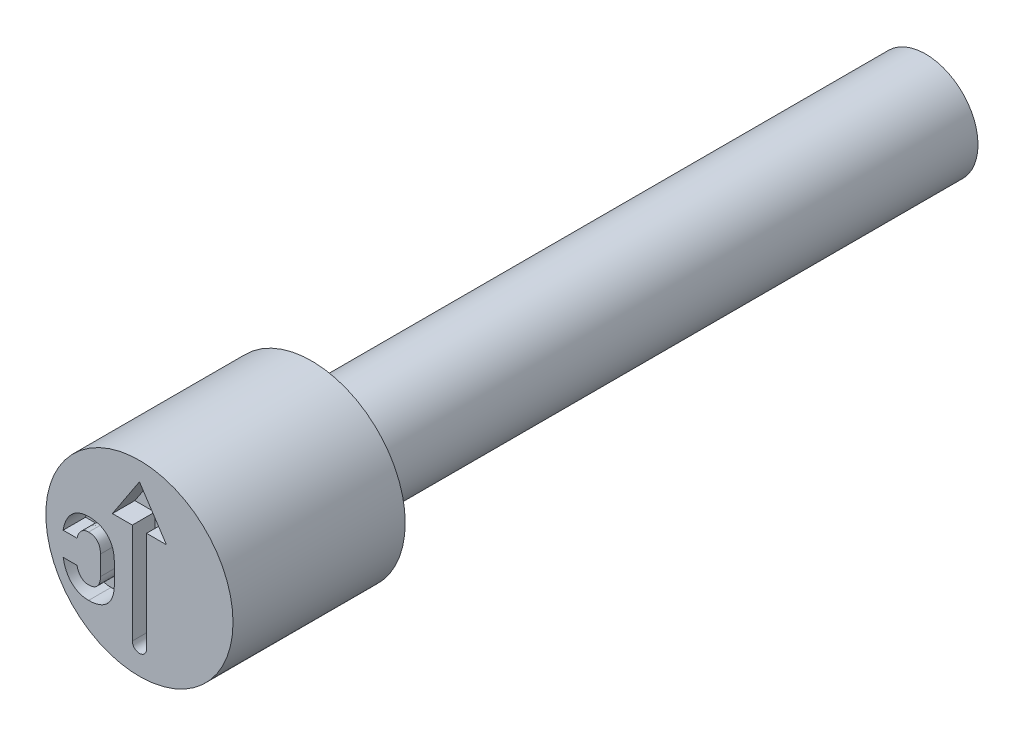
ISO-10303-21;
HEADER;
FILE_DESCRIPTION(('STEP AP214'),'2;1');
FILE_NAME('part.step','',(''),(''),'','','');
FILE_SCHEMA(('AUTOMOTIVE_DESIGN { 1 0 10303 214 1 1 1 1 }'));
ENDSEC;
DATA;
#1=APPLICATION_CONTEXT('core data for automotive mechanical design processes');
#2=APPLICATION_PROTOCOL_DEFINITION('international standard','automotive_design',2000,#1);
#3=PRODUCT_CONTEXT('',#1,'mechanical');
#4=PRODUCT('Part','Part','',(#3));
#5=PRODUCT_RELATED_PRODUCT_CATEGORY('part','',(#4));
#6=PRODUCT_DEFINITION_FORMATION('','',#4);
#7=PRODUCT_DEFINITION_CONTEXT('part definition',#1,'design');
#8=PRODUCT_DEFINITION('design','',#6,#7);
#9=PRODUCT_DEFINITION_SHAPE('','',#8);
#10=(LENGTH_UNIT() NAMED_UNIT(*) SI_UNIT(.MILLI.,.METRE.));
#11=(NAMED_UNIT(*) PLANE_ANGLE_UNIT() SI_UNIT($,.RADIAN.));
#12=(NAMED_UNIT(*) SI_UNIT($,.STERADIAN.) SOLID_ANGLE_UNIT());
#13=UNCERTAINTY_MEASURE_WITH_UNIT(LENGTH_MEASURE(1.E-05),#10,'distance_accuracy_value','');
#14=(GEOMETRIC_REPRESENTATION_CONTEXT(3) GLOBAL_UNCERTAINTY_ASSIGNED_CONTEXT((#13)) GLOBAL_UNIT_ASSIGNED_CONTEXT((#10,
#11,#12)) REPRESENTATION_CONTEXT('',''));
#15=CARTESIAN_POINT('',(0.,0.,0.));
#16=DIRECTION('',(0.,0.,1.));
#17=DIRECTION('',(1.,0.,0.));
#18=AXIS2_PLACEMENT_3D('',#15,#16,#17);
#19=CARTESIAN_POINT('',(0.,0.699999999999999,-2.3));
#20=DIRECTION('',(0.,0.,1.));
#21=DIRECTION('',(1.,0.,0.));
#22=AXIS2_PLACEMENT_3D('',#19,#20,#21);
#23=PLANE('',#22);
#24=CARTESIAN_POINT('',(0.,0.,-2.3));
#25=DIRECTION('',(0.,0.,1.));
#26=DIRECTION('',(1.,0.,0.));
#27=AXIS2_PLACEMENT_3D('',#24,#25,#26);
#28=CIRCLE('',#27,1.25);
#29=CARTESIAN_POINT('',(1.25,0.,-2.3));
#30=VERTEX_POINT('',#29);
#31=EDGE_CURVE('E11',#30,#30,#28,.T.);
#32=ORIENTED_EDGE('',*,*,#31,.F.);
#33=EDGE_LOOP('',(#32));
#34=FACE_BOUND('',#33,.T.);
#35=CARTESIAN_POINT('',(0.,0.,-2.3));
#36=DIRECTION('',(0.,0.,1.));
#37=DIRECTION('',(1.,0.,0.));
#38=AXIS2_PLACEMENT_3D('',#35,#36,#37);
#39=CIRCLE('',#38,0.699999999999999);
#40=CARTESIAN_POINT('',(0.699999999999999,0.,-2.3));
#41=VERTEX_POINT('',#40);
#42=EDGE_CURVE('E262',#41,#41,#39,.T.);
#43=ORIENTED_EDGE('',*,*,#42,.T.);
#44=EDGE_LOOP('',(#43));
#45=FACE_BOUND('',#44,.T.);
#46=ADVANCED_FACE('F34',(#34,#45),#23,.F.);
#47=CARTESIAN_POINT('',(0.,0.,-0.403888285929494));
#48=DIRECTION('',(0.,0.,1.));
#49=DIRECTION('',(1.,0.,0.));
#50=AXIS2_PLACEMENT_3D('',#47,#48,#49);
#51=CYLINDRICAL_SURFACE('',#50,1.25);
#52=CARTESIAN_POINT('',(0.,0.,0.));
#53=DIRECTION('',(0.,0.,1.));
#54=DIRECTION('',(1.,0.,0.));
#55=AXIS2_PLACEMENT_3D('',#52,#53,#54);
#56=CIRCLE('',#55,1.25);
#57=CARTESIAN_POINT('',(1.25,0.,0.));
#58=VERTEX_POINT('',#57);
#59=EDGE_CURVE('E41',#58,#58,#56,.T.);
#60=ORIENTED_EDGE('',*,*,#59,.F.);
#61=EDGE_LOOP('',(#60));
#62=FACE_BOUND('',#61,.T.);
#63=ORIENTED_EDGE('',*,*,#31,.T.);
#64=EDGE_LOOP('',(#63));
#65=FACE_BOUND('',#64,.T.);
#66=ADVANCED_FACE('F247',(#62,#65),#51,.T.);
#67=CARTESIAN_POINT('',(0.,1.25,0.));
#68=DIRECTION('',(0.,0.,-1.));
#69=DIRECTION('',(-1.,0.,0.));
#70=AXIS2_PLACEMENT_3D('',#67,#68,#69);
#71=PLANE('',#70);
#72=CARTESIAN_POINT('',(-0.678632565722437,-0.709873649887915,0.));
#73=CARTESIAN_POINT('',(-0.669787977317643,-0.709777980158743,0.));
#74=CARTESIAN_POINT('',(-0.652334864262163,-0.709589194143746,0.));
#75=CARTESIAN_POINT('',(-0.626671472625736,-0.70762484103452,0.));
#76=CARTESIAN_POINT('',(-0.601912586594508,-0.704341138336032,0.));
#77=CARTESIAN_POINT('',(-0.578193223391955,-0.69971053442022,0.));
#78=CARTESIAN_POINT('',(-0.555447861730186,-0.693868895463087,0.));
#79=CARTESIAN_POINT('',(-0.533579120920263,-0.686964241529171,0.));
#80=CARTESIAN_POINT('',(-0.512797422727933,-0.678416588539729,0.));
#81=CARTESIAN_POINT('',(-0.492901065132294,-0.668723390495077,0.));
#82=CARTESIAN_POINT('',(-0.474170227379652,-0.657752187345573,0.));
#83=CARTESIAN_POINT('',(-0.456644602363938,-0.645411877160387,0.));
#84=CARTESIAN_POINT('',(-0.440150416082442,-0.632089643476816,0.));
#85=CARTESIAN_POINT('',(-0.424812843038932,-0.617518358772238,0.));
#86=CARTESIAN_POINT('',(-0.410647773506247,-0.6017831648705,0.));
#87=CARTESIAN_POINT('',(-0.397574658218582,-0.584866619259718,0.));
#88=CARTESIAN_POINT('',(-0.385862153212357,-0.566660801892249,0.));
#89=CARTESIAN_POINT('',(-0.375147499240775,-0.547411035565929,0.));
#90=CARTESIAN_POINT('',(-0.365614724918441,-0.527064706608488,0.));
#91=CARTESIAN_POINT('',(-0.357568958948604,-0.505524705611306,0.));
#92=CARTESIAN_POINT('',(-0.350593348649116,-0.483028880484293,0.));
#93=CARTESIAN_POINT('',(-0.344758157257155,-0.459580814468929,0.));
#94=CARTESIAN_POINT('',(-0.340290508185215,-0.435073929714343,0.));
#95=CARTESIAN_POINT('',(-0.337312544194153,-0.409526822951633,0.));
#96=CARTESIAN_POINT('',(-0.335248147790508,-0.382915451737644,0.));
#97=CARTESIAN_POINT('',(-0.335077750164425,-0.364816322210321,0.));
#98=CARTESIAN_POINT('',(-0.334990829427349,-0.355583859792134,0.));
#99=B_SPLINE_CURVE_WITH_KNOTS('',3,(#72,#73,#74,#75,#76,#77,#78,#79,#80,#81,#82,#83,#84,#85,#86,
#87,#88,#89,#90,#91,#92,#93,#94,#95,#96,#97,#98),.UNSPECIFIED.,.F.,.F.,(4,1,1,1,1,1,1,1,1,1,1,1,
1,1,1,1,1,1,1,1,1,1,1,1,4),(0.,0.0472598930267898,0.093258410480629,0.137448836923,
0.180669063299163,0.222325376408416,0.262898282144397,0.303117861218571,0.342294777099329,
0.381096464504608,0.418984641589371,0.456742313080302,0.494310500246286,0.531916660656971,
0.569787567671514,0.608434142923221,0.647492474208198,0.687453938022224,0.728384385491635,
0.770272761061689,0.813266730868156,0.85743965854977,0.903297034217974,0.950671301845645,1.),.UNSPECIFIED.);
#100=CARTESIAN_POINT('',(-0.678632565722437,-0.709873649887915,0.));
#101=VERTEX_POINT('',#100);
#102=CARTESIAN_POINT('',(-0.334990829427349,-0.355583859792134,0.));
#103=VERTEX_POINT('',#102);
#104=EDGE_CURVE('E400',#101,#103,#99,.T.);
#105=ORIENTED_EDGE('',*,*,#104,.F.);
#106=CARTESIAN_POINT('',(-1.01898308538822,-0.38171999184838,0.));
#107=CARTESIAN_POINT('',(-1.01567440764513,-0.398507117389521,0.));
#108=CARTESIAN_POINT('',(-1.00924173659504,-0.43114434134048,0.));
#109=CARTESIAN_POINT('',(-0.994786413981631,-0.477622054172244,0.));
#110=CARTESIAN_POINT('',(-0.976972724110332,-0.520324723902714,0.));
#111=CARTESIAN_POINT('',(-0.955773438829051,-0.559188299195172,0.));
#112=CARTESIAN_POINT('',(-0.931059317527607,-0.593828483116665,0.));
#113=CARTESIAN_POINT('',(-0.903421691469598,-0.62437482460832,0.));
#114=CARTESIAN_POINT('',(-0.872627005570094,-0.650569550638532,0.));
#115=CARTESIAN_POINT('',(-0.838738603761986,-0.672149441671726,0.));
#116=CARTESIAN_POINT('',(-0.802147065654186,-0.689114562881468,0.));
#117=CARTESIAN_POINT('',(-0.763052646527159,-0.701028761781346,0.));
#118=CARTESIAN_POINT('',(-0.721656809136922,-0.708736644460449,0.));
#119=CARTESIAN_POINT('',(-0.693188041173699,-0.709488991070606,0.));
#120=CARTESIAN_POINT('',(-0.678632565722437,-0.709873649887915,0.));
#121=B_SPLINE_CURVE_WITH_KNOTS('',3,(#106,#107,#108,#109,#110,#111,#112,#113,#114,#115,#116,
#117,#118,#119,#120),.UNSPECIFIED.,.F.,.F.,(4,1,1,1,1,1,1,1,1,1,1,1,4),(0.,0.0988237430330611,
0.192131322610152,0.28071953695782,0.365844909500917,0.447392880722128,0.526064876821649,
0.603327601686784,0.680299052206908,0.757555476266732,0.835645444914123,0.915969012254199,1.),.UNSPECIFIED.);
#122=CARTESIAN_POINT('',(-1.01898308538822,-0.38171999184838,0.));
#123=VERTEX_POINT('',#122);
#124=EDGE_CURVE('E48',#123,#101,#121,.T.);
#125=ORIENTED_EDGE('',*,*,#124,.F.);
#126=DIRECTION('',(-1.,0.,0.));
#127=VECTOR('',#126,1.);
#128=CARTESIAN_POINT('',(-0.83351334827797,-0.38171999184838,0.));
#129=LINE('',#128,#127);
#130=CARTESIAN_POINT('',(-0.83351334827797,-0.38171999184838,0.));
#131=VERTEX_POINT('',#130);
#132=EDGE_CURVE('E185',#131,#123,#129,.T.);
#133=ORIENTED_EDGE('',*,*,#132,.F.);
#134=CARTESIAN_POINT('',(-0.678632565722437,-0.53079274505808,0.));
#135=CARTESIAN_POINT('',(-0.685031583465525,-0.530540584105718,0.));
#136=CARTESIAN_POINT('',(-0.697582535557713,-0.530045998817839,0.));
#137=CARTESIAN_POINT('',(-0.715918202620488,-0.527018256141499,0.));
#138=CARTESIAN_POINT('',(-0.733181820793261,-0.521438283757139,0.));
#139=CARTESIAN_POINT('',(-0.749489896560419,-0.513920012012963,0.));
#140=CARTESIAN_POINT('',(-0.764722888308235,-0.504206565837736,0.));
#141=CARTESIAN_POINT('',(-0.778446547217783,-0.492205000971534,0.));
#142=CARTESIAN_POINT('',(-0.791229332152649,-0.47854366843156,0.));
#143=CARTESIAN_POINT('',(-0.802606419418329,-0.462777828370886,0.));
#144=CARTESIAN_POINT('',(-0.812691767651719,-0.445134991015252,0.));
#145=CARTESIAN_POINT('',(-0.821125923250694,-0.425608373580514,0.));
#146=CARTESIAN_POINT('',(-0.828447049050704,-0.404415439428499,0.));
#147=CARTESIAN_POINT('',(-0.831789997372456,-0.389440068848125,0.));
#148=CARTESIAN_POINT('',(-0.83351334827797,-0.38171999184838,0.));
#149=B_SPLINE_CURVE_WITH_KNOTS('',3,(#134,#135,#136,#137,#138,#139,#140,#141,#142,#143,#144,
#145,#146,#147,#148),.UNSPECIFIED.,.F.,.F.,(4,1,1,1,1,1,1,1,1,1,1,1,4),(0.,0.0817564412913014,
0.160356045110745,0.236478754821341,0.312819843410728,0.389192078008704,0.466352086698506,
0.545094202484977,0.627698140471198,0.714093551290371,0.80415108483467,0.89903630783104,1.),.UNSPECIFIED.);
#150=CARTESIAN_POINT('',(-0.678632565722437,-0.53079274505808,0.));
#151=VERTEX_POINT('',#150);
#152=EDGE_CURVE('E188',#151,#131,#149,.T.);
#153=ORIENTED_EDGE('',*,*,#152,.F.);
#154=CARTESIAN_POINT('',(-0.520460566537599,-0.355583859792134,0.));
#155=CARTESIAN_POINT('',(-0.520669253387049,-0.364501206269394,0.));
#156=CARTESIAN_POINT('',(-0.521073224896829,-0.381763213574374,0.));
#157=CARTESIAN_POINT('',(-0.524573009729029,-0.406631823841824,0.));
#158=CARTESIAN_POINT('',(-0.530363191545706,-0.429507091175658,0.));
#159=CARTESIAN_POINT('',(-0.538396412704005,-0.450350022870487,0.));
#160=CARTESIAN_POINT('',(-0.548948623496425,-0.468863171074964,0.));
#161=CARTESIAN_POINT('',(-0.561480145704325,-0.48519607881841,0.));
#162=CARTESIAN_POINT('',(-0.576063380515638,-0.499309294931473,0.));
#163=CARTESIAN_POINT('',(-0.592924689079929,-0.510792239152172,0.));
#164=CARTESIAN_POINT('',(-0.611734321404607,-0.519774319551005,0.));
#165=CARTESIAN_POINT('',(-0.632420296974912,-0.526088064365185,0.));
#166=CARTESIAN_POINT('',(-0.654927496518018,-0.530051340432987,0.));
#167=CARTESIAN_POINT('',(-0.670548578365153,-0.530539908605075,0.));
#168=CARTESIAN_POINT('',(-0.678632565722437,-0.53079274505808,0.));
#169=B_SPLINE_CURVE_WITH_KNOTS('',3,(#154,#155,#156,#157,#158,#159,#160,#161,#162,#163,#164,
#165,#166,#167,#168),.UNSPECIFIED.,.F.,.F.,(4,1,1,1,1,1,1,1,1,1,1,1,4),(0.,0.0997433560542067,
0.193081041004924,0.280299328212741,0.363302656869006,0.442209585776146,0.517891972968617,
0.592965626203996,0.668275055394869,0.745143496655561,0.825309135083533,0.909596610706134,1.),.UNSPECIFIED.);
#170=CARTESIAN_POINT('',(-0.520460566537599,-0.355583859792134,0.));
#171=VERTEX_POINT('',#170);
#172=EDGE_CURVE('E348',#171,#151,#169,.T.);
#173=ORIENTED_EDGE('',*,*,#172,.F.);
#174=DIRECTION('',(0.,-1.,0.));
#175=VECTOR('',#174,1.);
#176=CARTESIAN_POINT('',(-0.520460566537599,-0.0949969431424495,0.));
#177=LINE('',#176,#175);
#178=CARTESIAN_POINT('',(-0.520460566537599,-0.0949969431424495,0.));
#179=VERTEX_POINT('',#178);
#180=EDGE_CURVE('E356',#179,#171,#177,.T.);
#181=ORIENTED_EDGE('',*,*,#180,.F.);
#182=CARTESIAN_POINT('',(-0.678632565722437,0.0807927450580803,0.));
#183=CARTESIAN_POINT('',(-0.670554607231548,0.0805099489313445,0.));
#184=CARTESIAN_POINT('',(-0.654955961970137,0.0799638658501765,0.));
#185=CARTESIAN_POINT('',(-0.632358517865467,0.0764063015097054,0.));
#186=CARTESIAN_POINT('',(-0.61177474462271,0.0697044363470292,0.));
#187=CARTESIAN_POINT('',(-0.592917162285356,0.0608137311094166,0.));
#188=CARTESIAN_POINT('',(-0.576071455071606,0.0492985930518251,0.));
#189=CARTESIAN_POINT('',(-0.561418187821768,0.0351820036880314,0.));
#190=CARTESIAN_POINT('',(-0.548949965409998,0.0186555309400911,0.));
#191=CARTESIAN_POINT('',(-0.538443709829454,3.57885835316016E-06,0.));
#192=CARTESIAN_POINT('',(-0.530320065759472,-0.0209320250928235,0.));
#193=CARTESIAN_POINT('',(-0.524604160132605,-0.0438929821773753,0.));
#194=CARTESIAN_POINT('',(-0.52106702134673,-0.0688159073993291,0.));
#195=CARTESIAN_POINT('',(-0.520667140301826,-0.0860790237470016,0.));
#196=CARTESIAN_POINT('',(-0.520460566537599,-0.0949969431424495,0.));
#197=B_SPLINE_CURVE_WITH_KNOTS('',3,(#182,#183,#184,#185,#186,#187,#188,#189,#190,#191,#192,
#193,#194,#195,#196),.UNSPECIFIED.,.F.,.F.,(4,1,1,1,1,1,1,1,1,1,1,1,4),(0.,0.0902231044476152,
0.174222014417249,0.25444494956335,0.331160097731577,0.406319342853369,0.481243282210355,
0.557346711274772,0.636723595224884,0.719561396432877,0.807304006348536,0.900455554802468,1.),.UNSPECIFIED.);
#198=CARTESIAN_POINT('',(-0.678632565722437,0.0807927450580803,0.));
#199=VERTEX_POINT('',#198);
#200=EDGE_CURVE('E362',#199,#179,#197,.T.);
#201=ORIENTED_EDGE('',*,*,#200,.F.);
#202=CARTESIAN_POINT('',(-0.83351334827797,-0.0680864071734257,0.));
#203=CARTESIAN_POINT('',(-0.831642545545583,-0.0604978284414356,0.));
#204=CARTESIAN_POINT('',(-0.828002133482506,-0.0457311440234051,0.));
#205=CARTESIAN_POINT('',(-0.820506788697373,-0.0247242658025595,0.));
#206=CARTESIAN_POINT('',(-0.811983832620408,-0.00526624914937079,0.));
#207=CARTESIAN_POINT('',(-0.801560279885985,0.0121793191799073,0.));
#208=CARTESIAN_POINT('',(-0.790213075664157,0.0280336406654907,0.));
#209=CARTESIAN_POINT('',(-0.777416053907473,0.0417693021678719,0.));
#210=CARTESIAN_POINT('',(-0.763449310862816,0.0536141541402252,0.));
#211=CARTESIAN_POINT('',(-0.748420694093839,0.0634106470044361,0.));
#212=CARTESIAN_POINT('',(-0.732371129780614,0.0713946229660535,0.));
#213=CARTESIAN_POINT('',(-0.715227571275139,0.0766784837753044,0.));
#214=CARTESIAN_POINT('',(-0.697226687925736,0.0801288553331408,0.));
#215=CARTESIAN_POINT('',(-0.684908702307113,0.080568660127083,0.));
#216=CARTESIAN_POINT('',(-0.678632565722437,0.0807927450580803,0.));
#217=B_SPLINE_CURVE_WITH_KNOTS('',3,(#202,#203,#204,#205,#206,#207,#208,#209,#210,#211,#212,
#213,#214,#215,#216),.UNSPECIFIED.,.F.,.F.,(4,1,1,1,1,1,1,1,1,1,1,1,4),(0.,0.100258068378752,
0.195093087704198,0.285925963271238,0.372441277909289,0.455447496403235,0.535743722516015,
0.612742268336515,0.689936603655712,0.765509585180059,0.842003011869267,0.919498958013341,1.),.UNSPECIFIED.);
#218=CARTESIAN_POINT('',(-0.83351334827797,-0.0680864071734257,0.));
#219=VERTEX_POINT('',#218);
#220=EDGE_CURVE('E367',#219,#199,#217,.T.);
#221=ORIENTED_EDGE('',*,*,#220,.F.);
#222=DIRECTION('',(1.,0.,0.));
#223=VECTOR('',#222,1.);
#224=CARTESIAN_POINT('',(-1.01898308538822,-0.0680864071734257,0.));
#225=LINE('',#224,#223);
#226=CARTESIAN_POINT('',(-1.01898308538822,-0.0680864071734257,0.));
#227=VERTEX_POINT('',#226);
#228=EDGE_CURVE('E375',#227,#219,#225,.T.);
#229=ORIENTED_EDGE('',*,*,#228,.F.);
#230=CARTESIAN_POINT('',(-0.678632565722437,0.259873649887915,0.));
#231=CARTESIAN_POINT('',(-0.693187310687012,0.259484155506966,0.));
#232=CARTESIAN_POINT('',(-0.721718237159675,0.258720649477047,0.));
#233=CARTESIAN_POINT('',(-0.763185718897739,0.251054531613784,0.));
#234=CARTESIAN_POINT('',(-0.802344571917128,0.23911930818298,0.));
#235=CARTESIAN_POINT('',(-0.838965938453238,0.222100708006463,0.));
#236=CARTESIAN_POINT('',(-0.872935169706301,0.200628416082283,0.));
#237=CARTESIAN_POINT('',(-0.903854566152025,0.174503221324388,0.));
#238=CARTESIAN_POINT('',(-0.931713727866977,0.144067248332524,0.));
#239=CARTESIAN_POINT('',(-0.956272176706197,0.109196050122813,0.));
#240=CARTESIAN_POINT('',(-0.977599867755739,0.0703762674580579,0.));
#241=CARTESIAN_POINT('',(-0.995157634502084,0.0276031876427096,0.));
#242=CARTESIAN_POINT('',(-1.00940933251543,-0.018804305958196,0.));
#243=CARTESIAN_POINT('',(-1.01573479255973,-0.0513654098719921,0.));
#244=CARTESIAN_POINT('',(-1.01898308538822,-0.0680864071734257,0.));
#245=B_SPLINE_CURVE_WITH_KNOTS('',3,(#230,#231,#232,#233,#234,#235,#236,#237,#238,#239,#240,
#241,#242,#243,#244),.UNSPECIFIED.,.F.,.F.,(4,1,1,1,1,1,1,1,1,1,1,1,4),(0.,0.0840057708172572,
0.164672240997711,0.242738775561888,0.319972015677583,0.397234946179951,0.474233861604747,
0.553133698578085,0.634960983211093,0.720060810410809,0.808478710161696,0.901648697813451,1.),.UNSPECIFIED.);
#246=CARTESIAN_POINT('',(-0.678632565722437,0.259873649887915,0.));
#247=VERTEX_POINT('',#246);
#248=EDGE_CURVE('E381',#247,#227,#245,.T.);
#249=ORIENTED_EDGE('',*,*,#248,.F.);
#250=CARTESIAN_POINT('',(-0.334990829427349,-0.0949969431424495,0.));
#251=CARTESIAN_POINT('',(-0.335077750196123,-0.0857644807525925,0.));
#252=CARTESIAN_POINT('',(-0.335248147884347,-0.0676653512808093,0.));
#253=CARTESIAN_POINT('',(-0.337312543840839,-0.0410539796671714,0.));
#254=CARTESIAN_POINT('',(-0.340290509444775,-0.0155068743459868,0.));
#255=CARTESIAN_POINT('',(-0.34475815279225,0.00900001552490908,0.));
#256=CARTESIAN_POINT('',(-0.350593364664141,0.0324480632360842,0.));
#257=CARTESIAN_POINT('',(-0.357568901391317,0.0549439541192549,0.));
#258=CARTESIAN_POINT('',(-0.365614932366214,0.0764837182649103,0.));
#259=CARTESIAN_POINT('',(-0.375146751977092,0.096830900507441,0.));
#260=CARTESIAN_POINT('',(-0.385864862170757,0.116077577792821,0.));
#261=CARTESIAN_POINT('',(-0.397564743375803,0.134294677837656,0.));
#262=CARTESIAN_POINT('',(-0.410713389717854,0.151208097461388,0.));
#263=CARTESIAN_POINT('',(-0.424743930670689,0.167128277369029,0.));
#264=CARTESIAN_POINT('',(-0.440159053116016,0.181695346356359,0.));
#265=CARTESIAN_POINT('',(-0.45664415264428,0.195022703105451,0.));
#266=CARTESIAN_POINT('',(-0.474163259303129,0.207380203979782,0.));
#267=CARTESIAN_POINT('',(-0.492955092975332,0.218289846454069,0.));
#268=CARTESIAN_POINT('',(-0.512736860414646,0.228286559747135,0.));
#269=CARTESIAN_POINT('',(-0.533626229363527,0.236698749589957,0.));
#270=CARTESIAN_POINT('',(-0.555404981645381,0.243933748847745,0.));
#271=CARTESIAN_POINT('',(-0.578199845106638,0.249690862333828,0.));
#272=CARTESIAN_POINT('',(-0.60191074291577,0.254346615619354,0.));
#273=CARTESIAN_POINT('',(-0.626671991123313,0.257623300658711,0.));
#274=CARTESIAN_POINT('',(-0.652334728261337,0.259589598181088,0.));
#275=CARTESIAN_POINT('',(-0.669787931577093,0.259778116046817,0.));
#276=CARTESIAN_POINT('',(-0.678632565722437,0.259873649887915,0.));
#277=B_SPLINE_CURVE_WITH_KNOTS('',3,(#250,#251,#252,#253,#254,#255,#256,#257,#258,#259,#260,
#261,#262,#263,#264,#265,#266,#267,#268,#269,#270,#271,#272,#273,#274,#275,#276),.UNSPECIFIED.,
.F.,.F.,(4,1,1,1,1,1,1,1,1,1,1,1,1,1,1,1,1,1,1,1,1,1,1,1,4),(0.,0.0493032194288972,
0.0966530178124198,0.142486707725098,0.186636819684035,0.229608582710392,0.271475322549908,
0.31238462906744,0.352325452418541,0.391363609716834,0.429990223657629,0.467841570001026,
0.505685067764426,0.543233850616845,0.580972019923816,0.618840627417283,0.657622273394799,
0.696931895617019,0.737130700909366,0.777789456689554,0.819424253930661,0.862622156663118,
0.906789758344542,0.952764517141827,1.),.UNSPECIFIED.);
#278=CARTESIAN_POINT('',(-0.334990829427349,-0.0949969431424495,0.));
#279=VERTEX_POINT('',#278);
#280=EDGE_CURVE('E386',#279,#247,#277,.T.);
#281=ORIENTED_EDGE('',*,*,#280,.F.);
#282=DIRECTION('',(0.,1.,0.));
#283=VECTOR('',#282,1.);
#284=CARTESIAN_POINT('',(-0.334990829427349,-0.355583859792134,0.));
#285=LINE('',#284,#283);
#286=EDGE_CURVE('E394',#103,#279,#285,.T.);
#287=ORIENTED_EDGE('',*,*,#286,.F.);
#288=EDGE_LOOP('',(#105,#125,#133,#153,#173,#181,#201,#221,#229,#249,#281,#287));
#289=FACE_BOUND('',#288,.T.);
#290=DIRECTION('',(0.,1.,0.));
#291=VECTOR('',#290,1.);
#292=CARTESIAN_POINT('',(0.0952365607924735,0.453175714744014,0.));
#293=LINE('',#292,#291);
#294=CARTESIAN_POINT('',(0.0952365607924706,-0.888080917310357,0.));
#295=VERTEX_POINT('',#294);
#296=CARTESIAN_POINT('',(0.0952365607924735,0.453175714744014,0.));
#297=VERTEX_POINT('',#296);
#298=EDGE_CURVE('E300',#295,#297,#293,.T.);
#299=ORIENTED_EDGE('',*,*,#298,.F.);
#300=CARTESIAN_POINT('',(0.,-0.888080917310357,0.));
#301=DIRECTION('',(0.,0.,1.));
#302=DIRECTION('',(1.,0.,0.));
#303=AXIS2_PLACEMENT_3D('',#300,#301,#302);
#304=CIRCLE('',#303,0.0952365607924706);
#305=CARTESIAN_POINT('',(-0.0952365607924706,-0.888080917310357,0.));
#306=VERTEX_POINT('',#305);
#307=EDGE_CURVE('E56',#306,#295,#304,.T.);
#308=ORIENTED_EDGE('',*,*,#307,.F.);
#309=DIRECTION('',(0.,-1.,0.));
#310=VECTOR('',#309,1.);
#311=CARTESIAN_POINT('',(-0.0952365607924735,0.453175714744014,0.));
#312=LINE('',#311,#310);
#313=CARTESIAN_POINT('',(-0.0952365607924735,0.453175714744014,0.));
#314=VERTEX_POINT('',#313);
#315=EDGE_CURVE('E284',#314,#306,#312,.T.);
#316=ORIENTED_EDGE('',*,*,#315,.F.);
#317=DIRECTION('',(1.,0.,0.));
#318=VECTOR('',#317,1.);
#319=CARTESIAN_POINT('',(-0.360958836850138,0.453175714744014,0.));
#320=LINE('',#319,#318);
#321=CARTESIAN_POINT('',(-0.360958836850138,0.453175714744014,0.));
#322=VERTEX_POINT('',#321);
#323=EDGE_CURVE('E288',#322,#314,#320,.T.);
#324=ORIENTED_EDGE('',*,*,#323,.F.);
#325=DIRECTION('',(-0.550159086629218,-0.835059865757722,0.));
#326=VECTOR('',#325,1.);
#327=CARTESIAN_POINT('',(0.,1.00105767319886,0.));
#328=LINE('',#327,#326);
#329=CARTESIAN_POINT('',(0.,1.00105767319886,0.));
#330=VERTEX_POINT('',#329);
#331=EDGE_CURVE('E291',#330,#322,#328,.T.);
#332=ORIENTED_EDGE('',*,*,#331,.F.);
#333=DIRECTION('',(-0.550159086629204,0.835059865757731,0.));
#334=VECTOR('',#333,1.);
#335=CARTESIAN_POINT('',(0.,1.00105767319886,0.));
#336=LINE('',#335,#334);
#337=CARTESIAN_POINT('',(0.360958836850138,0.453175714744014,0.));
#338=VERTEX_POINT('',#337);
#339=EDGE_CURVE('E294',#338,#330,#336,.T.);
#340=ORIENTED_EDGE('',*,*,#339,.F.);
#341=DIRECTION('',(1.,0.,0.));
#342=VECTOR('',#341,1.);
#343=CARTESIAN_POINT('',(0.360958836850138,0.453175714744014,0.));
#344=LINE('',#343,#342);
#345=EDGE_CURVE('E297',#297,#338,#344,.T.);
#346=ORIENTED_EDGE('',*,*,#345,.F.);
#347=EDGE_LOOP('',(#299,#308,#316,#324,#332,#340,#346));
#348=FACE_BOUND('',#347,.T.);
#349=ORIENTED_EDGE('',*,*,#59,.T.);
#350=EDGE_LOOP('',(#349));
#351=FACE_BOUND('',#350,.T.);
#352=ADVANCED_FACE('F244',(#289,#348,#351),#71,.F.);
#353=CARTESIAN_POINT('',(0.,0.,-10.5));
#354=DIRECTION('',(0.,0.,1.));
#355=DIRECTION('',(1.,0.,0.));
#356=AXIS2_PLACEMENT_3D('',#353,#354,#355);
#357=PLANE('',#356);
#358=CARTESIAN_POINT('',(0.,0.,-10.5));
#359=DIRECTION('',(0.,0.,1.));
#360=DIRECTION('',(1.,0.,0.));
#361=AXIS2_PLACEMENT_3D('',#358,#359,#360);
#362=CIRCLE('',#361,0.7);
#363=CARTESIAN_POINT('',(0.7,0.,-10.5));
#364=VERTEX_POINT('',#363);
#365=EDGE_CURVE('E263',#364,#364,#362,.T.);
#366=ORIENTED_EDGE('',*,*,#365,.F.);
#367=EDGE_LOOP('',(#366));
#368=FACE_BOUND('',#367,.T.);
#369=ADVANCED_FACE('F240',(#368),#357,.F.);
#370=CARTESIAN_POINT('',(0.,0.,-0.403888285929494));
#371=DIRECTION('',(0.,0.,1.));
#372=DIRECTION('',(1.,0.,0.));
#373=AXIS2_PLACEMENT_3D('',#370,#371,#372);
#374=CYLINDRICAL_SURFACE('',#373,0.699999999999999);
#375=ORIENTED_EDGE('',*,*,#42,.F.);
#376=EDGE_LOOP('',(#375));
#377=FACE_BOUND('',#376,.T.);
#378=ORIENTED_EDGE('',*,*,#365,.T.);
#379=EDGE_LOOP('',(#378));
#380=FACE_BOUND('',#379,.T.);
#381=ADVANCED_FACE('F237',(#377,#380),#374,.T.);
#382=CARTESIAN_POINT('',(0.,-0.888080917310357,-0.3));
#383=DIRECTION('',(0.,0.,1.));
#384=DIRECTION('',(1.,0.,0.));
#385=AXIS2_PLACEMENT_3D('',#382,#383,#384);
#386=CYLINDRICAL_SURFACE('',#385,0.0952365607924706);
#387=ORIENTED_EDGE('',*,*,#307,.T.);
#388=DIRECTION('',(0.,0.,1.));
#389=VECTOR('',#388,1.);
#390=CARTESIAN_POINT('',(0.0952365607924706,-0.888080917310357,-0.3));
#391=LINE('',#390,#389);
#392=CARTESIAN_POINT('',(0.0952365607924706,-0.888080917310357,-0.3));
#393=VERTEX_POINT('',#392);
#394=EDGE_CURVE('E271',#393,#295,#391,.T.);
#395=ORIENTED_EDGE('',*,*,#394,.F.);
#396=CARTESIAN_POINT('',(0.,-0.888080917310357,-0.3));
#397=DIRECTION('',(0.,0.,1.));
#398=DIRECTION('',(1.,0.,0.));
#399=AXIS2_PLACEMENT_3D('',#396,#397,#398);
#400=CIRCLE('',#399,0.0952365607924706);
#401=CARTESIAN_POINT('',(-0.0952365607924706,-0.888080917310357,-0.3));
#402=VERTEX_POINT('',#401);
#403=EDGE_CURVE('E287',#402,#393,#400,.T.);
#404=ORIENTED_EDGE('',*,*,#403,.F.);
#405=DIRECTION('',(0.,0.,1.));
#406=VECTOR('',#405,1.);
#407=CARTESIAN_POINT('',(-0.0952365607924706,-0.888080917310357,-0.3));
#408=LINE('',#407,#406);
#409=EDGE_CURVE('E264',#402,#306,#408,.T.);
#410=ORIENTED_EDGE('',*,*,#409,.T.);
#411=EDGE_LOOP('',(#387,#395,#404,#410));
#412=FACE_BOUND('',#411,.T.);
#413=ADVANCED_FACE('F215',(#412),#386,.F.);
#414=CARTESIAN_POINT('',(-0.0952365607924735,0.453175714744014,-0.3));
#415=DIRECTION('',(-1.,0.,0.));
#416=DIRECTION('',(0.,-1.,0.));
#417=AXIS2_PLACEMENT_3D('',#414,#415,#416);
#418=PLANE('',#417);
#419=ORIENTED_EDGE('',*,*,#315,.T.);
#420=ORIENTED_EDGE('',*,*,#409,.F.);
#421=DIRECTION('',(0.,-1.,0.));
#422=VECTOR('',#421,1.);
#423=CARTESIAN_POINT('',(-0.0952365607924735,0.453175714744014,-0.3));
#424=LINE('',#423,#422);
#425=CARTESIAN_POINT('',(-0.0952365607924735,0.453175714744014,-0.3));
#426=VERTEX_POINT('',#425);
#427=EDGE_CURVE('E275',#426,#402,#424,.T.);
#428=ORIENTED_EDGE('',*,*,#427,.F.);
#429=DIRECTION('',(0.,0.,1.));
#430=VECTOR('',#429,1.);
#431=CARTESIAN_POINT('',(-0.0952365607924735,0.453175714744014,-0.3));
#432=LINE('',#431,#430);
#433=EDGE_CURVE('E268',#426,#314,#432,.T.);
#434=ORIENTED_EDGE('',*,*,#433,.T.);
#435=EDGE_LOOP('',(#419,#420,#428,#434));
#436=FACE_BOUND('',#435,.T.);
#437=ADVANCED_FACE('F211',(#436),#418,.F.);
#438=CARTESIAN_POINT('',(-0.360958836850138,0.453175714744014,-0.3));
#439=DIRECTION('',(0.,-1.,0.));
#440=DIRECTION('',(0.,0.,-1.));
#441=AXIS2_PLACEMENT_3D('',#438,#439,#440);
#442=PLANE('',#441);
#443=ORIENTED_EDGE('',*,*,#323,.T.);
#444=ORIENTED_EDGE('',*,*,#433,.F.);
#445=DIRECTION('',(1.,0.,0.));
#446=VECTOR('',#445,1.);
#447=CARTESIAN_POINT('',(-0.360958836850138,0.453175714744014,-0.3));
#448=LINE('',#447,#446);
#449=CARTESIAN_POINT('',(-0.360958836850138,0.453175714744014,-0.3));
#450=VERTEX_POINT('',#449);
#451=EDGE_CURVE('E307',#450,#426,#448,.T.);
#452=ORIENTED_EDGE('',*,*,#451,.F.);
#453=DIRECTION('',(0.,0.,1.));
#454=VECTOR('',#453,1.);
#455=CARTESIAN_POINT('',(-0.360958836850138,0.453175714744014,-0.3));
#456=LINE('',#455,#454);
#457=EDGE_CURVE('E281',#450,#322,#456,.T.);
#458=ORIENTED_EDGE('',*,*,#457,.T.);
#459=EDGE_LOOP('',(#443,#444,#452,#458));
#460=FACE_BOUND('',#459,.T.);
#461=ADVANCED_FACE('F214',(#460),#442,.F.);
#462=CARTESIAN_POINT('',(0.,1.00105767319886,-0.3));
#463=DIRECTION('',(-0.835059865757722,0.550159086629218,0.));
#464=DIRECTION('',(-0.550159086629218,-0.835059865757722,0.));
#465=AXIS2_PLACEMENT_3D('',#462,#463,#464);
#466=PLANE('',#465);
#467=ORIENTED_EDGE('',*,*,#331,.T.);
#468=ORIENTED_EDGE('',*,*,#457,.F.);
#469=DIRECTION('',(-0.550159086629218,-0.835059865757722,0.));
#470=VECTOR('',#469,1.);
#471=CARTESIAN_POINT('',(0.,1.00105767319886,-0.3));
#472=LINE('',#471,#470);
#473=CARTESIAN_POINT('',(0.,1.00105767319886,-0.3));
#474=VERTEX_POINT('',#473);
#475=EDGE_CURVE('E310',#474,#450,#472,.T.);
#476=ORIENTED_EDGE('',*,*,#475,.F.);
#477=DIRECTION('',(0.,0.,1.));
#478=VECTOR('',#477,1.);
#479=CARTESIAN_POINT('',(0.,1.00105767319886,-0.3));
#480=LINE('',#479,#478);
#481=EDGE_CURVE('E279',#474,#330,#480,.T.);
#482=ORIENTED_EDGE('',*,*,#481,.T.);
#483=EDGE_LOOP('',(#467,#468,#476,#482));
#484=FACE_BOUND('',#483,.T.);
#485=ADVANCED_FACE('F219',(#484),#466,.F.);
#486=CARTESIAN_POINT('',(0.,1.00105767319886,-0.3));
#487=DIRECTION('',(0.835059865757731,0.550159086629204,0.));
#488=DIRECTION('',(-0.550159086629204,0.835059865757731,0.));
#489=AXIS2_PLACEMENT_3D('',#486,#487,#488);
#490=PLANE('',#489);
#491=ORIENTED_EDGE('',*,*,#339,.T.);
#492=ORIENTED_EDGE('',*,*,#481,.F.);
#493=DIRECTION('',(-0.550159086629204,0.835059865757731,0.));
#494=VECTOR('',#493,1.);
#495=CARTESIAN_POINT('',(0.,1.00105767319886,-0.3));
#496=LINE('',#495,#494);
#497=CARTESIAN_POINT('',(0.360958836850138,0.453175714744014,-0.3));
#498=VERTEX_POINT('',#497);
#499=EDGE_CURVE('E313',#498,#474,#496,.T.);
#500=ORIENTED_EDGE('',*,*,#499,.F.);
#501=DIRECTION('',(0.,0.,1.));
#502=VECTOR('',#501,1.);
#503=CARTESIAN_POINT('',(0.360958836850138,0.453175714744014,-0.3));
#504=LINE('',#503,#502);
#505=EDGE_CURVE('E277',#498,#338,#504,.T.);
#506=ORIENTED_EDGE('',*,*,#505,.T.);
#507=EDGE_LOOP('',(#491,#492,#500,#506));
#508=FACE_BOUND('',#507,.T.);
#509=ADVANCED_FACE('F223',(#508),#490,.F.);
#510=CARTESIAN_POINT('',(0.360958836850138,0.453175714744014,-0.3));
#511=DIRECTION('',(0.,-1.,0.));
#512=DIRECTION('',(0.,0.,-1.));
#513=AXIS2_PLACEMENT_3D('',#510,#511,#512);
#514=PLANE('',#513);
#515=ORIENTED_EDGE('',*,*,#345,.T.);
#516=ORIENTED_EDGE('',*,*,#505,.F.);
#517=DIRECTION('',(1.,0.,0.));
#518=VECTOR('',#517,1.);
#519=CARTESIAN_POINT('',(0.360958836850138,0.453175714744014,-0.3));
#520=LINE('',#519,#518);
#521=CARTESIAN_POINT('',(0.0952365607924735,0.453175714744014,-0.3));
#522=VERTEX_POINT('',#521);
#523=EDGE_CURVE('E316',#522,#498,#520,.T.);
#524=ORIENTED_EDGE('',*,*,#523,.F.);
#525=DIRECTION('',(0.,0.,1.));
#526=VECTOR('',#525,1.);
#527=CARTESIAN_POINT('',(0.0952365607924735,0.453175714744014,-0.3));
#528=LINE('',#527,#526);
#529=EDGE_CURVE('E274',#522,#297,#528,.T.);
#530=ORIENTED_EDGE('',*,*,#529,.T.);
#531=EDGE_LOOP('',(#515,#516,#524,#530));
#532=FACE_BOUND('',#531,.T.);
#533=ADVANCED_FACE('F227',(#532),#514,.F.);
#534=CARTESIAN_POINT('',(0.0952365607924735,0.453175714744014,-0.3));
#535=DIRECTION('',(1.,0.,0.));
#536=DIRECTION('',(0.,1.,0.));
#537=AXIS2_PLACEMENT_3D('',#534,#535,#536);
#538=PLANE('',#537);
#539=ORIENTED_EDGE('',*,*,#298,.T.);
#540=ORIENTED_EDGE('',*,*,#529,.F.);
#541=DIRECTION('',(0.,1.,0.));
#542=VECTOR('',#541,1.);
#543=CARTESIAN_POINT('',(0.0952365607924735,0.453175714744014,-0.3));
#544=LINE('',#543,#542);
#545=EDGE_CURVE('E319',#393,#522,#544,.T.);
#546=ORIENTED_EDGE('',*,*,#545,.F.);
#547=ORIENTED_EDGE('',*,*,#394,.T.);
#548=EDGE_LOOP('',(#539,#540,#546,#547));
#549=FACE_BOUND('',#548,.T.);
#550=ADVANCED_FACE('F209',(#549),#538,.F.);
#551=CARTESIAN_POINT('',(0.,-0.888080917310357,-0.3));
#552=DIRECTION('',(0.,0.,1.));
#553=DIRECTION('',(1.,0.,0.));
#554=AXIS2_PLACEMENT_3D('',#551,#552,#553);
#555=PLANE('',#554);
#556=ORIENTED_EDGE('',*,*,#403,.T.);
#557=ORIENTED_EDGE('',*,*,#545,.T.);
#558=ORIENTED_EDGE('',*,*,#523,.T.);
#559=ORIENTED_EDGE('',*,*,#499,.T.);
#560=ORIENTED_EDGE('',*,*,#475,.T.);
#561=ORIENTED_EDGE('',*,*,#451,.T.);
#562=ORIENTED_EDGE('',*,*,#427,.T.);
#563=EDGE_LOOP('',(#556,#557,#558,#559,#560,#561,#562));
#564=FACE_BOUND('',#563,.T.);
#565=ADVANCED_FACE('F205',(#564),#555,.T.);
#566=CARTESIAN_POINT('',(-1.01898308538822,-0.38171999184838,-0.3));
#567=CARTESIAN_POINT('',(-1.01567440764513,-0.398507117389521,-0.3));
#568=CARTESIAN_POINT('',(-1.00924173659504,-0.43114434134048,-0.3));
#569=CARTESIAN_POINT('',(-0.994786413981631,-0.477622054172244,-0.3));
#570=CARTESIAN_POINT('',(-0.976972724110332,-0.520324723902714,-0.3));
#571=CARTESIAN_POINT('',(-0.955773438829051,-0.559188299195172,-0.3));
#572=CARTESIAN_POINT('',(-0.931059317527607,-0.593828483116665,-0.3));
#573=CARTESIAN_POINT('',(-0.903421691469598,-0.62437482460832,-0.3));
#574=CARTESIAN_POINT('',(-0.872627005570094,-0.650569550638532,-0.3));
#575=CARTESIAN_POINT('',(-0.838738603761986,-0.672149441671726,-0.3));
#576=CARTESIAN_POINT('',(-0.802147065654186,-0.689114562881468,-0.3));
#577=CARTESIAN_POINT('',(-0.763052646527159,-0.701028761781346,-0.3));
#578=CARTESIAN_POINT('',(-0.721656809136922,-0.708736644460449,-0.3));
#579=CARTESIAN_POINT('',(-0.693188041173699,-0.709488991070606,-0.3));
#580=CARTESIAN_POINT('',(-0.678632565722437,-0.709873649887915,-0.3));
#581=B_SPLINE_CURVE_WITH_KNOTS('',3,(#566,#567,#568,#569,#570,#571,#572,#573,#574,#575,#576,
#577,#578,#579,#580),.UNSPECIFIED.,.F.,.F.,(4,1,1,1,1,1,1,1,1,1,1,1,4),(0.,0.0988237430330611,
0.192131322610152,0.28071953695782,0.365844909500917,0.447392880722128,0.526064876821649,
0.603327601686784,0.680299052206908,0.757555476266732,0.835645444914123,0.915969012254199,1.),.UNSPECIFIED.);
#582=DIRECTION('',(0.,0.,1.));
#583=VECTOR('',#582,1.);
#584=SURFACE_OF_LINEAR_EXTRUSION('',#581,#583);
#585=ORIENTED_EDGE('',*,*,#124,.T.);
#586=DIRECTION('',(0.,0.,1.));
#587=VECTOR('',#586,1.);
#588=CARTESIAN_POINT('',(-0.678632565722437,-0.709873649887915,-0.3));
#589=LINE('',#588,#587);
#590=CARTESIAN_POINT('',(-0.678632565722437,-0.709873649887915,-0.3));
#591=VERTEX_POINT('',#590);
#592=EDGE_CURVE('E162',#591,#101,#589,.T.);
#593=ORIENTED_EDGE('',*,*,#592,.F.);
#594=CARTESIAN_POINT('',(-1.01898308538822,-0.38171999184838,-0.3));
#595=VERTEX_POINT('',#594);
#596=EDGE_CURVE('E166',#595,#591,#581,.T.);
#597=ORIENTED_EDGE('',*,*,#596,.F.);
#598=DIRECTION('',(0.,0.,1.));
#599=VECTOR('',#598,1.);
#600=CARTESIAN_POINT('',(-1.01898308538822,-0.38171999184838,-0.3));
#601=LINE('',#600,#599);
#602=EDGE_CURVE('E304',#595,#123,#601,.T.);
#603=ORIENTED_EDGE('',*,*,#602,.T.);
#604=EDGE_LOOP('',(#585,#593,#597,#603));
#605=FACE_BOUND('',#604,.T.);
#606=ADVANCED_FACE('F164',(#605),#584,.F.);
#607=CARTESIAN_POINT('',(-0.83351334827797,-0.38171999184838,-0.3));
#608=DIRECTION('',(0.,1.,0.));
#609=DIRECTION('',(0.,0.,1.));
#610=AXIS2_PLACEMENT_3D('',#607,#608,#609);
#611=PLANE('',#610);
#612=ORIENTED_EDGE('',*,*,#132,.T.);
#613=ORIENTED_EDGE('',*,*,#602,.F.);
#614=DIRECTION('',(-1.,0.,0.));
#615=VECTOR('',#614,1.);
#616=CARTESIAN_POINT('',(-0.83351334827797,-0.38171999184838,-0.3));
#617=LINE('',#616,#615);
#618=CARTESIAN_POINT('',(-0.83351334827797,-0.38171999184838,-0.3));
#619=VERTEX_POINT('',#618);
#620=EDGE_CURVE('E172',#619,#595,#617,.T.);
#621=ORIENTED_EDGE('',*,*,#620,.F.);
#622=DIRECTION('',(0.,0.,1.));
#623=VECTOR('',#622,1.);
#624=CARTESIAN_POINT('',(-0.83351334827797,-0.38171999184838,-0.3));
#625=LINE('',#624,#623);
#626=EDGE_CURVE('E341',#619,#131,#625,.T.);
#627=ORIENTED_EDGE('',*,*,#626,.T.);
#628=EDGE_LOOP('',(#612,#613,#621,#627));
#629=FACE_BOUND('',#628,.T.);
#630=ADVANCED_FACE('F204',(#629),#611,.F.);
#631=CARTESIAN_POINT('',(-0.678632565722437,-0.53079274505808,-0.3));
#632=CARTESIAN_POINT('',(-0.685031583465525,-0.530540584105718,-0.3));
#633=CARTESIAN_POINT('',(-0.697582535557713,-0.530045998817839,-0.3));
#634=CARTESIAN_POINT('',(-0.715918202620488,-0.527018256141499,-0.3));
#635=CARTESIAN_POINT('',(-0.733181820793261,-0.521438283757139,-0.3));
#636=CARTESIAN_POINT('',(-0.749489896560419,-0.513920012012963,-0.3));
#637=CARTESIAN_POINT('',(-0.764722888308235,-0.504206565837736,-0.3));
#638=CARTESIAN_POINT('',(-0.778446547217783,-0.492205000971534,-0.3));
#639=CARTESIAN_POINT('',(-0.791229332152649,-0.47854366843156,-0.3));
#640=CARTESIAN_POINT('',(-0.802606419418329,-0.462777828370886,-0.3));
#641=CARTESIAN_POINT('',(-0.812691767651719,-0.445134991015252,-0.3));
#642=CARTESIAN_POINT('',(-0.821125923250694,-0.425608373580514,-0.3));
#643=CARTESIAN_POINT('',(-0.828447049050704,-0.404415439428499,-0.3));
#644=CARTESIAN_POINT('',(-0.831789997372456,-0.389440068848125,-0.3));
#645=CARTESIAN_POINT('',(-0.83351334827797,-0.38171999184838,-0.3));
#646=B_SPLINE_CURVE_WITH_KNOTS('',3,(#631,#632,#633,#634,#635,#636,#637,#638,#639,#640,#641,
#642,#643,#644,#645),.UNSPECIFIED.,.F.,.F.,(4,1,1,1,1,1,1,1,1,1,1,1,4),(0.,0.0817564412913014,
0.160356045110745,0.236478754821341,0.312819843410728,0.389192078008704,0.466352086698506,
0.545094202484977,0.627698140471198,0.714093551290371,0.80415108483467,0.89903630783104,1.),.UNSPECIFIED.);
#647=DIRECTION('',(0.,0.,1.));
#648=VECTOR('',#647,1.);
#649=SURFACE_OF_LINEAR_EXTRUSION('',#646,#648);
#650=ORIENTED_EDGE('',*,*,#152,.T.);
#651=ORIENTED_EDGE('',*,*,#626,.F.);
#652=CARTESIAN_POINT('',(-0.678632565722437,-0.53079274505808,-0.3));
#653=VERTEX_POINT('',#652);
#654=EDGE_CURVE('E414',#653,#619,#646,.T.);
#655=ORIENTED_EDGE('',*,*,#654,.F.);
#656=DIRECTION('',(0.,0.,1.));
#657=VECTOR('',#656,1.);
#658=CARTESIAN_POINT('',(-0.678632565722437,-0.53079274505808,-0.3));
#659=LINE('',#658,#657);
#660=EDGE_CURVE('E339',#653,#151,#659,.T.);
#661=ORIENTED_EDGE('',*,*,#660,.T.);
#662=EDGE_LOOP('',(#650,#651,#655,#661));
#663=FACE_BOUND('',#662,.T.);
#664=ADVANCED_FACE('F428',(#663),#649,.F.);
#665=CARTESIAN_POINT('',(-0.520460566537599,-0.355583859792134,-0.3));
#666=CARTESIAN_POINT('',(-0.520669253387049,-0.364501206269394,-0.3));
#667=CARTESIAN_POINT('',(-0.521073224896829,-0.381763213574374,-0.3));
#668=CARTESIAN_POINT('',(-0.524573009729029,-0.406631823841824,-0.3));
#669=CARTESIAN_POINT('',(-0.530363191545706,-0.429507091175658,-0.3));
#670=CARTESIAN_POINT('',(-0.538396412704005,-0.450350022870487,-0.3));
#671=CARTESIAN_POINT('',(-0.548948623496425,-0.468863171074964,-0.3));
#672=CARTESIAN_POINT('',(-0.561480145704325,-0.48519607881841,-0.3));
#673=CARTESIAN_POINT('',(-0.576063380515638,-0.499309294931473,-0.3));
#674=CARTESIAN_POINT('',(-0.592924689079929,-0.510792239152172,-0.3));
#675=CARTESIAN_POINT('',(-0.611734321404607,-0.519774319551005,-0.3));
#676=CARTESIAN_POINT('',(-0.632420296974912,-0.526088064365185,-0.3));
#677=CARTESIAN_POINT('',(-0.654927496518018,-0.530051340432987,-0.3));
#678=CARTESIAN_POINT('',(-0.670548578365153,-0.530539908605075,-0.3));
#679=CARTESIAN_POINT('',(-0.678632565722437,-0.53079274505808,-0.3));
#680=B_SPLINE_CURVE_WITH_KNOTS('',3,(#665,#666,#667,#668,#669,#670,#671,#672,#673,#674,#675,
#676,#677,#678,#679),.UNSPECIFIED.,.F.,.F.,(4,1,1,1,1,1,1,1,1,1,1,1,4),(0.,0.0997433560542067,
0.193081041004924,0.280299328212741,0.363302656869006,0.442209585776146,0.517891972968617,
0.592965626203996,0.668275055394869,0.745143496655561,0.825309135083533,0.909596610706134,1.),.UNSPECIFIED.);
#681=DIRECTION('',(0.,0.,1.));
#682=VECTOR('',#681,1.);
#683=SURFACE_OF_LINEAR_EXTRUSION('',#680,#682);
#684=ORIENTED_EDGE('',*,*,#172,.T.);
#685=ORIENTED_EDGE('',*,*,#660,.F.);
#686=CARTESIAN_POINT('',(-0.520460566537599,-0.355583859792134,-0.3));
#687=VERTEX_POINT('',#686);
#688=EDGE_CURVE('E419',#687,#653,#680,.T.);
#689=ORIENTED_EDGE('',*,*,#688,.F.);
#690=DIRECTION('',(0.,0.,1.));
#691=VECTOR('',#690,1.);
#692=CARTESIAN_POINT('',(-0.520460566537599,-0.355583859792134,-0.3));
#693=LINE('',#692,#691);
#694=EDGE_CURVE('E337',#687,#171,#693,.T.);
#695=ORIENTED_EDGE('',*,*,#694,.T.);
#696=EDGE_LOOP('',(#684,#685,#689,#695));
#697=FACE_BOUND('',#696,.T.);
#698=ADVANCED_FACE('F432',(#697),#683,.F.);
#699=CARTESIAN_POINT('',(-0.520460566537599,-0.0949969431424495,-0.3));
#700=DIRECTION('',(-1.,0.,0.));
#701=DIRECTION('',(0.,0.,1.));
#702=AXIS2_PLACEMENT_3D('',#699,#700,#701);
#703=PLANE('',#702);
#704=ORIENTED_EDGE('',*,*,#180,.T.);
#705=ORIENTED_EDGE('',*,*,#694,.F.);
#706=DIRECTION('',(0.,-1.,0.));
#707=VECTOR('',#706,1.);
#708=CARTESIAN_POINT('',(-0.520460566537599,-0.0949969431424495,-0.3));
#709=LINE('',#708,#707);
#710=CARTESIAN_POINT('',(-0.520460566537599,-0.0949969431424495,-0.3));
#711=VERTEX_POINT('',#710);
#712=EDGE_CURVE('E455',#711,#687,#709,.T.);
#713=ORIENTED_EDGE('',*,*,#712,.F.);
#714=DIRECTION('',(0.,0.,1.));
#715=VECTOR('',#714,1.);
#716=CARTESIAN_POINT('',(-0.520460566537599,-0.0949969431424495,-0.3));
#717=LINE('',#716,#715);
#718=EDGE_CURVE('E335',#711,#179,#717,.T.);
#719=ORIENTED_EDGE('',*,*,#718,.T.);
#720=EDGE_LOOP('',(#704,#705,#713,#719));
#721=FACE_BOUND('',#720,.T.);
#722=ADVANCED_FACE('F437',(#721),#703,.F.);
#723=CARTESIAN_POINT('',(-0.678632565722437,0.0807927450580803,-0.3));
#724=CARTESIAN_POINT('',(-0.670554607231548,0.0805099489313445,-0.3));
#725=CARTESIAN_POINT('',(-0.654955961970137,0.0799638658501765,-0.3));
#726=CARTESIAN_POINT('',(-0.632358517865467,0.0764063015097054,-0.3));
#727=CARTESIAN_POINT('',(-0.61177474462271,0.0697044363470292,-0.3));
#728=CARTESIAN_POINT('',(-0.592917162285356,0.0608137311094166,-0.3));
#729=CARTESIAN_POINT('',(-0.576071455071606,0.0492985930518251,-0.3));
#730=CARTESIAN_POINT('',(-0.561418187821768,0.0351820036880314,-0.3));
#731=CARTESIAN_POINT('',(-0.548949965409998,0.0186555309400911,-0.3));
#732=CARTESIAN_POINT('',(-0.538443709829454,3.57885835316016E-06,-0.3));
#733=CARTESIAN_POINT('',(-0.530320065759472,-0.0209320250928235,-0.3));
#734=CARTESIAN_POINT('',(-0.524604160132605,-0.0438929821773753,-0.3));
#735=CARTESIAN_POINT('',(-0.52106702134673,-0.0688159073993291,-0.3));
#736=CARTESIAN_POINT('',(-0.520667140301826,-0.0860790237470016,-0.3));
#737=CARTESIAN_POINT('',(-0.520460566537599,-0.0949969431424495,-0.3));
#738=B_SPLINE_CURVE_WITH_KNOTS('',3,(#723,#724,#725,#726,#727,#728,#729,#730,#731,#732,#733,
#734,#735,#736,#737),.UNSPECIFIED.,.F.,.F.,(4,1,1,1,1,1,1,1,1,1,1,1,4),(0.,0.0902231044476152,
0.174222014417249,0.25444494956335,0.331160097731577,0.406319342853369,0.481243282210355,
0.557346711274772,0.636723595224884,0.719561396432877,0.807304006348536,0.900455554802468,1.),.UNSPECIFIED.);
#739=DIRECTION('',(0.,0.,1.));
#740=VECTOR('',#739,1.);
#741=SURFACE_OF_LINEAR_EXTRUSION('',#738,#740);
#742=ORIENTED_EDGE('',*,*,#200,.T.);
#743=ORIENTED_EDGE('',*,*,#718,.F.);
#744=CARTESIAN_POINT('',(-0.678632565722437,0.0807927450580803,-0.3));
#745=VERTEX_POINT('',#744);
#746=EDGE_CURVE('E450',#745,#711,#738,.T.);
#747=ORIENTED_EDGE('',*,*,#746,.F.);
#748=DIRECTION('',(0.,0.,1.));
#749=VECTOR('',#748,1.);
#750=CARTESIAN_POINT('',(-0.678632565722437,0.0807927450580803,-0.3));
#751=LINE('',#750,#749);
#752=EDGE_CURVE('E333',#745,#199,#751,.T.);
#753=ORIENTED_EDGE('',*,*,#752,.T.);
#754=EDGE_LOOP('',(#742,#743,#747,#753));
#755=FACE_BOUND('',#754,.T.);
#756=ADVANCED_FACE('F441',(#755),#741,.F.);
#757=CARTESIAN_POINT('',(-0.83351334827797,-0.0680864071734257,-0.3));
#758=CARTESIAN_POINT('',(-0.831642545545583,-0.0604978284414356,-0.3));
#759=CARTESIAN_POINT('',(-0.828002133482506,-0.0457311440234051,-0.3));
#760=CARTESIAN_POINT('',(-0.820506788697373,-0.0247242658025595,-0.3));
#761=CARTESIAN_POINT('',(-0.811983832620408,-0.00526624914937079,-0.3));
#762=CARTESIAN_POINT('',(-0.801560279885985,0.0121793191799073,-0.3));
#763=CARTESIAN_POINT('',(-0.790213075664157,0.0280336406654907,-0.3));
#764=CARTESIAN_POINT('',(-0.777416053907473,0.0417693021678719,-0.3));
#765=CARTESIAN_POINT('',(-0.763449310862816,0.0536141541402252,-0.3));
#766=CARTESIAN_POINT('',(-0.748420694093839,0.0634106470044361,-0.3));
#767=CARTESIAN_POINT('',(-0.732371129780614,0.0713946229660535,-0.3));
#768=CARTESIAN_POINT('',(-0.715227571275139,0.0766784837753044,-0.3));
#769=CARTESIAN_POINT('',(-0.697226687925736,0.0801288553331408,-0.3));
#770=CARTESIAN_POINT('',(-0.684908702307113,0.080568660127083,-0.3));
#771=CARTESIAN_POINT('',(-0.678632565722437,0.0807927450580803,-0.3));
#772=B_SPLINE_CURVE_WITH_KNOTS('',3,(#757,#758,#759,#760,#761,#762,#763,#764,#765,#766,#767,
#768,#769,#770,#771),.UNSPECIFIED.,.F.,.F.,(4,1,1,1,1,1,1,1,1,1,1,1,4),(0.,0.100258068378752,
0.195093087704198,0.285925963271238,0.372441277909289,0.455447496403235,0.535743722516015,
0.612742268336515,0.689936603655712,0.765509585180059,0.842003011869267,0.919498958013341,1.),.UNSPECIFIED.);
#773=DIRECTION('',(0.,0.,1.));
#774=VECTOR('',#773,1.);
#775=SURFACE_OF_LINEAR_EXTRUSION('',#772,#774);
#776=ORIENTED_EDGE('',*,*,#220,.T.);
#777=ORIENTED_EDGE('',*,*,#752,.F.);
#778=CARTESIAN_POINT('',(-0.83351334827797,-0.0680864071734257,-0.3));
#779=VERTEX_POINT('',#778);
#780=EDGE_CURVE('E456',#779,#745,#772,.T.);
#781=ORIENTED_EDGE('',*,*,#780,.F.);
#782=DIRECTION('',(0.,0.,1.));
#783=VECTOR('',#782,1.);
#784=CARTESIAN_POINT('',(-0.83351334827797,-0.0680864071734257,-0.3));
#785=LINE('',#784,#783);
#786=EDGE_CURVE('E331',#779,#219,#785,.T.);
#787=ORIENTED_EDGE('',*,*,#786,.T.);
#788=EDGE_LOOP('',(#776,#777,#781,#787));
#789=FACE_BOUND('',#788,.T.);
#790=ADVANCED_FACE('F446',(#789),#775,.F.);
#791=CARTESIAN_POINT('',(-1.01898308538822,-0.0680864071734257,-0.3));
#792=DIRECTION('',(0.,-1.,0.));
#793=DIRECTION('',(0.,0.,-1.));
#794=AXIS2_PLACEMENT_3D('',#791,#792,#793);
#795=PLANE('',#794);
#796=ORIENTED_EDGE('',*,*,#228,.T.);
#797=ORIENTED_EDGE('',*,*,#786,.F.);
#798=DIRECTION('',(1.,0.,0.));
#799=VECTOR('',#798,1.);
#800=CARTESIAN_POINT('',(-1.01898308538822,-0.0680864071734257,-0.3));
#801=LINE('',#800,#799);
#802=CARTESIAN_POINT('',(-1.01898308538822,-0.0680864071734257,-0.3));
#803=VERTEX_POINT('',#802);
#804=EDGE_CURVE('E676',#803,#779,#801,.T.);
#805=ORIENTED_EDGE('',*,*,#804,.F.);
#806=DIRECTION('',(0.,0.,1.));
#807=VECTOR('',#806,1.);
#808=CARTESIAN_POINT('',(-1.01898308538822,-0.0680864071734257,-0.3));
#809=LINE('',#808,#807);
#810=EDGE_CURVE('E329',#803,#227,#809,.T.);
#811=ORIENTED_EDGE('',*,*,#810,.T.);
#812=EDGE_LOOP('',(#796,#797,#805,#811));
#813=FACE_BOUND('',#812,.T.);
#814=ADVANCED_FACE('F533',(#813),#795,.F.);
#815=CARTESIAN_POINT('',(-0.678632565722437,0.259873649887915,-0.3));
#816=CARTESIAN_POINT('',(-0.693187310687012,0.259484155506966,-0.3));
#817=CARTESIAN_POINT('',(-0.721718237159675,0.258720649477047,-0.3));
#818=CARTESIAN_POINT('',(-0.763185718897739,0.251054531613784,-0.3));
#819=CARTESIAN_POINT('',(-0.802344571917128,0.23911930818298,-0.3));
#820=CARTESIAN_POINT('',(-0.838965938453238,0.222100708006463,-0.3));
#821=CARTESIAN_POINT('',(-0.872935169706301,0.200628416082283,-0.3));
#822=CARTESIAN_POINT('',(-0.903854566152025,0.174503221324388,-0.3));
#823=CARTESIAN_POINT('',(-0.931713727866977,0.144067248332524,-0.3));
#824=CARTESIAN_POINT('',(-0.956272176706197,0.109196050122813,-0.3));
#825=CARTESIAN_POINT('',(-0.977599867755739,0.0703762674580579,-0.3));
#826=CARTESIAN_POINT('',(-0.995157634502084,0.0276031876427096,-0.3));
#827=CARTESIAN_POINT('',(-1.00940933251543,-0.018804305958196,-0.3));
#828=CARTESIAN_POINT('',(-1.01573479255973,-0.0513654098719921,-0.3));
#829=CARTESIAN_POINT('',(-1.01898308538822,-0.0680864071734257,-0.3));
#830=B_SPLINE_CURVE_WITH_KNOTS('',3,(#815,#816,#817,#818,#819,#820,#821,#822,#823,#824,#825,
#826,#827,#828,#829),.UNSPECIFIED.,.F.,.F.,(4,1,1,1,1,1,1,1,1,1,1,1,4),(0.,0.0840057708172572,
0.164672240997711,0.242738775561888,0.319972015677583,0.397234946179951,0.474233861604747,
0.553133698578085,0.634960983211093,0.720060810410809,0.808478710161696,0.901648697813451,1.),.UNSPECIFIED.);
#831=DIRECTION('',(0.,0.,1.));
#832=VECTOR('',#831,1.);
#833=SURFACE_OF_LINEAR_EXTRUSION('',#830,#832);
#834=ORIENTED_EDGE('',*,*,#248,.T.);
#835=ORIENTED_EDGE('',*,*,#810,.F.);
#836=CARTESIAN_POINT('',(-0.678632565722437,0.259873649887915,-0.3));
#837=VERTEX_POINT('',#836);
#838=EDGE_CURVE('E482',#837,#803,#830,.T.);
#839=ORIENTED_EDGE('',*,*,#838,.F.);
#840=DIRECTION('',(0.,0.,1.));
#841=VECTOR('',#840,1.);
#842=CARTESIAN_POINT('',(-0.678632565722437,0.259873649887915,-0.3));
#843=LINE('',#842,#841);
#844=EDGE_CURVE('E327',#837,#247,#843,.T.);
#845=ORIENTED_EDGE('',*,*,#844,.T.);
#846=EDGE_LOOP('',(#834,#835,#839,#845));
#847=FACE_BOUND('',#846,.T.);
#848=ADVANCED_FACE('F498',(#847),#833,.F.);
#849=CARTESIAN_POINT('',(-0.334990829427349,-0.0949969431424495,-0.3));
#850=CARTESIAN_POINT('',(-0.335077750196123,-0.0857644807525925,-0.3));
#851=CARTESIAN_POINT('',(-0.335248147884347,-0.0676653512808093,-0.3));
#852=CARTESIAN_POINT('',(-0.337312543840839,-0.0410539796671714,-0.3));
#853=CARTESIAN_POINT('',(-0.340290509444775,-0.0155068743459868,-0.3));
#854=CARTESIAN_POINT('',(-0.34475815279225,0.00900001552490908,-0.3));
#855=CARTESIAN_POINT('',(-0.350593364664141,0.0324480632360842,-0.3));
#856=CARTESIAN_POINT('',(-0.357568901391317,0.0549439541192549,-0.3));
#857=CARTESIAN_POINT('',(-0.365614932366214,0.0764837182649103,-0.3));
#858=CARTESIAN_POINT('',(-0.375146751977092,0.096830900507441,-0.3));
#859=CARTESIAN_POINT('',(-0.385864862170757,0.116077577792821,-0.3));
#860=CARTESIAN_POINT('',(-0.397564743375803,0.134294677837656,-0.3));
#861=CARTESIAN_POINT('',(-0.410713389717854,0.151208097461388,-0.3));
#862=CARTESIAN_POINT('',(-0.424743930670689,0.167128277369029,-0.3));
#863=CARTESIAN_POINT('',(-0.440159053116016,0.181695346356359,-0.3));
#864=CARTESIAN_POINT('',(-0.45664415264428,0.195022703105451,-0.3));
#865=CARTESIAN_POINT('',(-0.474163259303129,0.207380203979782,-0.3));
#866=CARTESIAN_POINT('',(-0.492955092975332,0.218289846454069,-0.3));
#867=CARTESIAN_POINT('',(-0.512736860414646,0.228286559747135,-0.3));
#868=CARTESIAN_POINT('',(-0.533626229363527,0.236698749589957,-0.3));
#869=CARTESIAN_POINT('',(-0.555404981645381,0.243933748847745,-0.3));
#870=CARTESIAN_POINT('',(-0.578199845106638,0.249690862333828,-0.3));
#871=CARTESIAN_POINT('',(-0.60191074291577,0.254346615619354,-0.3));
#872=CARTESIAN_POINT('',(-0.626671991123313,0.257623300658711,-0.3));
#873=CARTESIAN_POINT('',(-0.652334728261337,0.259589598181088,-0.3));
#874=CARTESIAN_POINT('',(-0.669787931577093,0.259778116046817,-0.3));
#875=CARTESIAN_POINT('',(-0.678632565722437,0.259873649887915,-0.3));
#876=B_SPLINE_CURVE_WITH_KNOTS('',3,(#849,#850,#851,#852,#853,#854,#855,#856,#857,#858,#859,
#860,#861,#862,#863,#864,#865,#866,#867,#868,#869,#870,#871,#872,#873,#874,#875),.UNSPECIFIED.,
.F.,.F.,(4,1,1,1,1,1,1,1,1,1,1,1,1,1,1,1,1,1,1,1,1,1,1,1,4),(0.,0.0493032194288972,
0.0966530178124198,0.142486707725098,0.186636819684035,0.229608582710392,0.271475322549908,
0.31238462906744,0.352325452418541,0.391363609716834,0.429990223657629,0.467841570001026,
0.505685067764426,0.543233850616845,0.580972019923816,0.618840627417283,0.657622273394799,
0.696931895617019,0.737130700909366,0.777789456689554,0.819424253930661,0.862622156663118,
0.906789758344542,0.952764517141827,1.),.UNSPECIFIED.);
#877=DIRECTION('',(0.,0.,1.));
#878=VECTOR('',#877,1.);
#879=SURFACE_OF_LINEAR_EXTRUSION('',#876,#878);
#880=ORIENTED_EDGE('',*,*,#280,.T.);
#881=ORIENTED_EDGE('',*,*,#844,.F.);
#882=CARTESIAN_POINT('',(-0.334990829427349,-0.0949969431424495,-0.3));
#883=VERTEX_POINT('',#882);
#884=EDGE_CURVE('E481',#883,#837,#876,.T.);
#885=ORIENTED_EDGE('',*,*,#884,.F.);
#886=DIRECTION('',(0.,0.,1.));
#887=VECTOR('',#886,1.);
#888=CARTESIAN_POINT('',(-0.334990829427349,-0.0949969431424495,-0.3));
#889=LINE('',#888,#887);
#890=EDGE_CURVE('E325',#883,#279,#889,.T.);
#891=ORIENTED_EDGE('',*,*,#890,.T.);
#892=EDGE_LOOP('',(#880,#881,#885,#891));
#893=FACE_BOUND('',#892,.T.);
#894=ADVANCED_FACE('F495',(#893),#879,.F.);
#895=CARTESIAN_POINT('',(-0.334990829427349,-0.355583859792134,-0.3));
#896=DIRECTION('',(1.,0.,0.));
#897=DIRECTION('',(0.,0.,-1.));
#898=AXIS2_PLACEMENT_3D('',#895,#896,#897);
#899=PLANE('',#898);
#900=ORIENTED_EDGE('',*,*,#286,.T.);
#901=ORIENTED_EDGE('',*,*,#890,.F.);
#902=DIRECTION('',(0.,1.,0.));
#903=VECTOR('',#902,1.);
#904=CARTESIAN_POINT('',(-0.334990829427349,-0.355583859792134,-0.3));
#905=LINE('',#904,#903);
#906=CARTESIAN_POINT('',(-0.334990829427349,-0.355583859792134,-0.3));
#907=VERTEX_POINT('',#906);
#908=EDGE_CURVE('E180',#907,#883,#905,.T.);
#909=ORIENTED_EDGE('',*,*,#908,.F.);
#910=DIRECTION('',(0.,0.,1.));
#911=VECTOR('',#910,1.);
#912=CARTESIAN_POINT('',(-0.334990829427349,-0.355583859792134,-0.3));
#913=LINE('',#912,#911);
#914=EDGE_CURVE('E171',#907,#103,#913,.T.);
#915=ORIENTED_EDGE('',*,*,#914,.T.);
#916=EDGE_LOOP('',(#900,#901,#909,#915));
#917=FACE_BOUND('',#916,.T.);
#918=ADVANCED_FACE('F478',(#917),#899,.F.);
#919=CARTESIAN_POINT('',(-0.678632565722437,-0.709873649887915,-0.3));
#920=CARTESIAN_POINT('',(-0.669787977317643,-0.709777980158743,-0.3));
#921=CARTESIAN_POINT('',(-0.652334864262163,-0.709589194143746,-0.3));
#922=CARTESIAN_POINT('',(-0.626671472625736,-0.70762484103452,-0.3));
#923=CARTESIAN_POINT('',(-0.601912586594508,-0.704341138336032,-0.3));
#924=CARTESIAN_POINT('',(-0.578193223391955,-0.69971053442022,-0.3));
#925=CARTESIAN_POINT('',(-0.555447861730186,-0.693868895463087,-0.3));
#926=CARTESIAN_POINT('',(-0.533579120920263,-0.686964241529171,-0.3));
#927=CARTESIAN_POINT('',(-0.512797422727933,-0.678416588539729,-0.3));
#928=CARTESIAN_POINT('',(-0.492901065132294,-0.668723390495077,-0.3));
#929=CARTESIAN_POINT('',(-0.474170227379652,-0.657752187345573,-0.3));
#930=CARTESIAN_POINT('',(-0.456644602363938,-0.645411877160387,-0.3));
#931=CARTESIAN_POINT('',(-0.440150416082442,-0.632089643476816,-0.3));
#932=CARTESIAN_POINT('',(-0.424812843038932,-0.617518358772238,-0.3));
#933=CARTESIAN_POINT('',(-0.410647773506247,-0.6017831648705,-0.3));
#934=CARTESIAN_POINT('',(-0.397574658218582,-0.584866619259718,-0.3));
#935=CARTESIAN_POINT('',(-0.385862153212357,-0.566660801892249,-0.3));
#936=CARTESIAN_POINT('',(-0.375147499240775,-0.547411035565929,-0.3));
#937=CARTESIAN_POINT('',(-0.365614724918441,-0.527064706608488,-0.3));
#938=CARTESIAN_POINT('',(-0.357568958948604,-0.505524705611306,-0.3));
#939=CARTESIAN_POINT('',(-0.350593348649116,-0.483028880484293,-0.3));
#940=CARTESIAN_POINT('',(-0.344758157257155,-0.459580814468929,-0.3));
#941=CARTESIAN_POINT('',(-0.340290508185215,-0.435073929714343,-0.3));
#942=CARTESIAN_POINT('',(-0.337312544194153,-0.409526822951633,-0.3));
#943=CARTESIAN_POINT('',(-0.335248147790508,-0.382915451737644,-0.3));
#944=CARTESIAN_POINT('',(-0.335077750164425,-0.364816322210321,-0.3));
#945=CARTESIAN_POINT('',(-0.334990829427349,-0.355583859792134,-0.3));
#946=B_SPLINE_CURVE_WITH_KNOTS('',3,(#919,#920,#921,#922,#923,#924,#925,#926,#927,#928,#929,
#930,#931,#932,#933,#934,#935,#936,#937,#938,#939,#940,#941,#942,#943,#944,#945),.UNSPECIFIED.,
.F.,.F.,(4,1,1,1,1,1,1,1,1,1,1,1,1,1,1,1,1,1,1,1,1,1,1,1,4),(0.,0.0472598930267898,
0.093258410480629,0.137448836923,0.180669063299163,0.222325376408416,0.262898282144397,
0.303117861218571,0.342294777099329,0.381096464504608,0.418984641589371,0.456742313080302,
0.494310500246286,0.531916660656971,0.569787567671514,0.608434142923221,0.647492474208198,
0.687453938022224,0.728384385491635,0.770272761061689,0.813266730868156,0.85743965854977,
0.903297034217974,0.950671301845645,1.),.UNSPECIFIED.);
#947=DIRECTION('',(0.,0.,1.));
#948=VECTOR('',#947,1.);
#949=SURFACE_OF_LINEAR_EXTRUSION('',#946,#948);
#950=ORIENTED_EDGE('',*,*,#104,.T.);
#951=ORIENTED_EDGE('',*,*,#914,.F.);
#952=EDGE_CURVE('E175',#591,#907,#946,.T.);
#953=ORIENTED_EDGE('',*,*,#952,.F.);
#954=ORIENTED_EDGE('',*,*,#592,.T.);
#955=EDGE_LOOP('',(#950,#951,#953,#954));
#956=FACE_BOUND('',#955,.T.);
#957=ADVANCED_FACE('F176',(#956),#949,.F.);
#958=CARTESIAN_POINT('',(-0.912147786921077,-0.614288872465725,-0.3));
#959=DIRECTION('',(0.,0.,-1.));
#960=DIRECTION('',(-1.,0.,0.));
#961=AXIS2_PLACEMENT_3D('',#958,#959,#960);
#962=PLANE('',#961);
#963=ORIENTED_EDGE('',*,*,#596,.T.);
#964=ORIENTED_EDGE('',*,*,#952,.T.);
#965=ORIENTED_EDGE('',*,*,#908,.T.);
#966=ORIENTED_EDGE('',*,*,#884,.T.);
#967=ORIENTED_EDGE('',*,*,#838,.T.);
#968=ORIENTED_EDGE('',*,*,#804,.T.);
#969=ORIENTED_EDGE('',*,*,#780,.T.);
#970=ORIENTED_EDGE('',*,*,#746,.T.);
#971=ORIENTED_EDGE('',*,*,#712,.T.);
#972=ORIENTED_EDGE('',*,*,#688,.T.);
#973=ORIENTED_EDGE('',*,*,#654,.T.);
#974=ORIENTED_EDGE('',*,*,#620,.T.);
#975=EDGE_LOOP('',(#963,#964,#965,#966,#967,#968,#969,#970,#971,#972,#973,#974));
#976=FACE_BOUND('',#975,.T.);
#977=ADVANCED_FACE('F182',(#976),#962,.F.);
#978=CLOSED_SHELL('',(#46,#66,#352,#369,#381,#413,#437,#461,#485,#509,#533,#550,#565,#606,#630,
#664,#698,#722,#756,#790,#814,#848,#894,#918,#957,#977));
#979=MANIFOLD_SOLID_BREP('B2',#978);
#980=ADVANCED_BREP_SHAPE_REPRESENTATION('',(#18,#979),#14);
#981=SHAPE_DEFINITION_REPRESENTATION(#9,#980);
ENDSEC;
END-ISO-10303-21;
